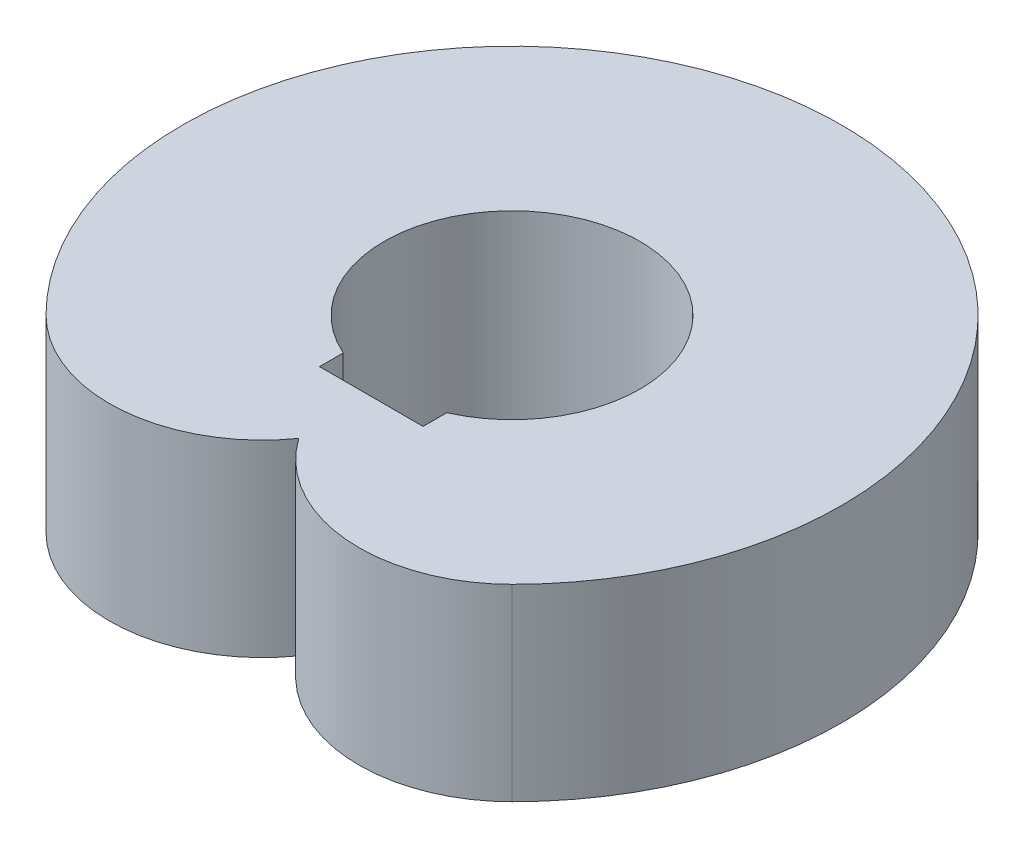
ISO-10303-21;
HEADER;
FILE_DESCRIPTION(('STEP AP214'),'2;1');
FILE_NAME('part.step','',(''),(''),'','','');
FILE_SCHEMA(('AUTOMOTIVE_DESIGN { 1 0 10303 214 1 1 1 1 }'));
ENDSEC;
DATA;
#1=APPLICATION_CONTEXT('core data for automotive mechanical design processes');
#2=APPLICATION_PROTOCOL_DEFINITION('international standard','automotive_design',2000,#1);
#3=PRODUCT_CONTEXT('',#1,'mechanical');
#4=PRODUCT('Part','Part','',(#3));
#5=PRODUCT_RELATED_PRODUCT_CATEGORY('part','',(#4));
#6=PRODUCT_DEFINITION_FORMATION('','',#4);
#7=PRODUCT_DEFINITION_CONTEXT('part definition',#1,'design');
#8=PRODUCT_DEFINITION('design','',#6,#7);
#9=PRODUCT_DEFINITION_SHAPE('','',#8);
#10=(LENGTH_UNIT() NAMED_UNIT(*) SI_UNIT(.MILLI.,.METRE.));
#11=(NAMED_UNIT(*) PLANE_ANGLE_UNIT() SI_UNIT($,.RADIAN.));
#12=(NAMED_UNIT(*) SI_UNIT($,.STERADIAN.) SOLID_ANGLE_UNIT());
#13=UNCERTAINTY_MEASURE_WITH_UNIT(LENGTH_MEASURE(1.E-05),#10,'distance_accuracy_value','');
#14=(GEOMETRIC_REPRESENTATION_CONTEXT(3) GLOBAL_UNCERTAINTY_ASSIGNED_CONTEXT((#13)) GLOBAL_UNIT_ASSIGNED_CONTEXT((#10,
#11,#12)) REPRESENTATION_CONTEXT('',''));
#15=CARTESIAN_POINT('',(0.,0.,0.));
#16=DIRECTION('',(0.,0.,1.));
#17=DIRECTION('',(1.,0.,0.));
#18=AXIS2_PLACEMENT_3D('',#15,#16,#17);
#19=CARTESIAN_POINT('',(132.582521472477,400.,132.582521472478));
#20=DIRECTION('',(0.,1.,0.));
#21=DIRECTION('',(0.,0.,1.));
#22=AXIS2_PLACEMENT_3D('',#19,#20,#21);
#23=PLANE('',#22);
#24=CARTESIAN_POINT('',(265.165042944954,400.,265.165042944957));
#25=DIRECTION('',(0.,1.,0.));
#26=DIRECTION('',(0.,0.,1.));
#27=AXIS2_PLACEMENT_3D('',#24,#25,#26);
#28=CIRCLE('',#27,325.);
#29=CARTESIAN_POINT('',(1.11022302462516E-13,400.,453.08124767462));
#30=VERTEX_POINT('',#29);
#31=CARTESIAN_POINT('',(494.974746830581,400.,494.974746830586));
#32=VERTEX_POINT('',#31);
#33=EDGE_CURVE('E130',#30,#32,#28,.T.);
#34=ORIENTED_EDGE('',*,*,#33,.T.);
#35=CARTESIAN_POINT('',(0.,400.,0.));
#36=DIRECTION('',(0.,1.,0.));
#37=DIRECTION('',(0.,0.,1.));
#38=AXIS2_PLACEMENT_3D('',#35,#36,#37);
#39=CIRCLE('',#38,700.);
#40=CARTESIAN_POINT('',(-494.97474683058,400.,494.974746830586));
#41=VERTEX_POINT('',#40);
#42=EDGE_CURVE('E133',#32,#41,#39,.T.);
#43=ORIENTED_EDGE('',*,*,#42,.T.);
#44=CARTESIAN_POINT('',(-265.165042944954,400.,265.165042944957));
#45=DIRECTION('',(0.,1.,0.));
#46=DIRECTION('',(0.,0.,1.));
#47=AXIS2_PLACEMENT_3D('',#44,#45,#46);
#48=CIRCLE('',#47,325.);
#49=EDGE_CURVE('E136',#41,#30,#48,.T.);
#50=ORIENTED_EDGE('',*,*,#49,.T.);
#51=EDGE_LOOP('',(#34,#43,#50));
#52=FACE_BOUND('',#51,.T.);
#53=DIRECTION('',(1.,0.,0.));
#54=VECTOR('',#53,1.);
#55=CARTESIAN_POINT('',(-110.000000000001,400.,299.));
#56=LINE('',#55,#54);
#57=CARTESIAN_POINT('',(-110.000000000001,400.,299.));
#58=VERTEX_POINT('',#57);
#59=CARTESIAN_POINT('',(110.000000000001,400.,299.));
#60=VERTEX_POINT('',#59);
#61=EDGE_CURVE('E102',#58,#60,#56,.T.);
#62=ORIENTED_EDGE('',*,*,#61,.F.);
#63=DIRECTION('',(0.,0.,1.));
#64=VECTOR('',#63,1.);
#65=CARTESIAN_POINT('',(-110.000000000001,400.,248.581419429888));
#66=LINE('',#65,#64);
#67=CARTESIAN_POINT('',(-110.000000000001,400.,248.581419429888));
#68=VERTEX_POINT('',#67);
#69=EDGE_CURVE('E94',#68,#58,#66,.T.);
#70=ORIENTED_EDGE('',*,*,#69,.F.);
#71=CARTESIAN_POINT('',(0.,400.,0.));
#72=DIRECTION('',(0.,1.,0.));
#73=DIRECTION('',(0.,0.,1.));
#74=AXIS2_PLACEMENT_3D('',#71,#72,#73);
#75=CIRCLE('',#74,271.832157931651);
#76=CARTESIAN_POINT('',(110.000000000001,400.,248.581419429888));
#77=VERTEX_POINT('',#76);
#78=EDGE_CURVE('E116',#77,#68,#75,.T.);
#79=ORIENTED_EDGE('',*,*,#78,.F.);
#80=DIRECTION('',(0.,0.,-1.));
#81=VECTOR('',#80,1.);
#82=CARTESIAN_POINT('',(110.000000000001,400.,248.581419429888));
#83=LINE('',#82,#81);
#84=EDGE_CURVE('E114',#60,#77,#83,.T.);
#85=ORIENTED_EDGE('',*,*,#84,.F.);
#86=EDGE_LOOP('',(#62,#70,#79,#85));
#87=FACE_BOUND('',#86,.T.);
#88=ADVANCED_FACE('F35',(#52,#87),#23,.T.);
#89=CARTESIAN_POINT('',(132.582521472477,0.,132.582521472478));
#90=DIRECTION('',(0.,1.,0.));
#91=DIRECTION('',(0.,0.,1.));
#92=AXIS2_PLACEMENT_3D('',#89,#90,#91);
#93=PLANE('',#92);
#94=CARTESIAN_POINT('',(265.165042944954,0.,265.165042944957));
#95=DIRECTION('',(0.,1.,0.));
#96=DIRECTION('',(0.,0.,1.));
#97=AXIS2_PLACEMENT_3D('',#94,#95,#96);
#98=CIRCLE('',#97,325.);
#99=CARTESIAN_POINT('',(1.11022302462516E-13,0.,453.08124767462));
#100=VERTEX_POINT('',#99);
#101=CARTESIAN_POINT('',(494.974746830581,0.,494.974746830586));
#102=VERTEX_POINT('',#101);
#103=EDGE_CURVE('E110',#100,#102,#98,.T.);
#104=ORIENTED_EDGE('',*,*,#103,.F.);
#105=CARTESIAN_POINT('',(-265.165042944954,0.,265.165042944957));
#106=DIRECTION('',(0.,1.,0.));
#107=DIRECTION('',(0.,0.,1.));
#108=AXIS2_PLACEMENT_3D('',#105,#106,#107);
#109=CIRCLE('',#108,325.);
#110=CARTESIAN_POINT('',(-494.97474683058,0.,494.974746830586));
#111=VERTEX_POINT('',#110);
#112=EDGE_CURVE('E134',#111,#100,#109,.T.);
#113=ORIENTED_EDGE('',*,*,#112,.F.);
#114=CARTESIAN_POINT('',(0.,0.,0.));
#115=DIRECTION('',(0.,1.,0.));
#116=DIRECTION('',(0.,0.,1.));
#117=AXIS2_PLACEMENT_3D('',#114,#115,#116);
#118=CIRCLE('',#117,700.);
#119=EDGE_CURVE('E141',#102,#111,#118,.T.);
#120=ORIENTED_EDGE('',*,*,#119,.F.);
#121=EDGE_LOOP('',(#104,#113,#120));
#122=FACE_BOUND('',#121,.T.);
#123=DIRECTION('',(0.,0.,1.));
#124=VECTOR('',#123,1.);
#125=CARTESIAN_POINT('',(-110.000000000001,0.,248.581419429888));
#126=LINE('',#125,#124);
#127=CARTESIAN_POINT('',(-110.000000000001,0.,248.581419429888));
#128=VERTEX_POINT('',#127);
#129=CARTESIAN_POINT('',(-110.000000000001,0.,299.));
#130=VERTEX_POINT('',#129);
#131=EDGE_CURVE('E58',#128,#130,#126,.T.);
#132=ORIENTED_EDGE('',*,*,#131,.T.);
#133=DIRECTION('',(1.,0.,0.));
#134=VECTOR('',#133,1.);
#135=CARTESIAN_POINT('',(-110.000000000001,0.,299.));
#136=LINE('',#135,#134);
#137=CARTESIAN_POINT('',(110.000000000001,0.,299.));
#138=VERTEX_POINT('',#137);
#139=EDGE_CURVE('E109',#130,#138,#136,.T.);
#140=ORIENTED_EDGE('',*,*,#139,.T.);
#141=DIRECTION('',(0.,0.,-1.));
#142=VECTOR('',#141,1.);
#143=CARTESIAN_POINT('',(110.000000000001,0.,248.581419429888));
#144=LINE('',#143,#142);
#145=CARTESIAN_POINT('',(110.000000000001,0.,248.581419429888));
#146=VERTEX_POINT('',#145);
#147=EDGE_CURVE('E122',#138,#146,#144,.T.);
#148=ORIENTED_EDGE('',*,*,#147,.T.);
#149=CARTESIAN_POINT('',(0.,0.,0.));
#150=DIRECTION('',(0.,1.,0.));
#151=DIRECTION('',(0.,0.,1.));
#152=AXIS2_PLACEMENT_3D('',#149,#150,#151);
#153=CIRCLE('',#152,271.832157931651);
#154=EDGE_CURVE('E103',#146,#128,#153,.T.);
#155=ORIENTED_EDGE('',*,*,#154,.T.);
#156=EDGE_LOOP('',(#132,#140,#148,#155));
#157=FACE_BOUND('',#156,.T.);
#158=ADVANCED_FACE('F155',(#122,#157),#93,.F.);
#159=CARTESIAN_POINT('',(265.165042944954,400.,265.165042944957));
#160=DIRECTION('',(0.,-1.,0.));
#161=DIRECTION('',(0.,0.,-1.));
#162=AXIS2_PLACEMENT_3D('',#159,#160,#161);
#163=CYLINDRICAL_SURFACE('',#162,325.);
#164=ORIENTED_EDGE('',*,*,#103,.T.);
#165=DIRECTION('',(0.,-1.,0.));
#166=VECTOR('',#165,1.);
#167=CARTESIAN_POINT('',(494.974746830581,400.,494.974746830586));
#168=LINE('',#167,#166);
#169=EDGE_CURVE('E11',#32,#102,#168,.T.);
#170=ORIENTED_EDGE('',*,*,#169,.F.);
#171=ORIENTED_EDGE('',*,*,#33,.F.);
#172=DIRECTION('',(0.,-1.,0.));
#173=VECTOR('',#172,1.);
#174=CARTESIAN_POINT('',(1.11022302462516E-13,400.,453.08124767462));
#175=LINE('',#174,#173);
#176=EDGE_CURVE('E138',#30,#100,#175,.T.);
#177=ORIENTED_EDGE('',*,*,#176,.T.);
#178=EDGE_LOOP('',(#164,#170,#171,#177));
#179=FACE_BOUND('',#178,.T.);
#180=ADVANCED_FACE('F37',(#179),#163,.T.);
#181=CARTESIAN_POINT('',(0.,400.,0.));
#182=DIRECTION('',(0.,-1.,0.));
#183=DIRECTION('',(0.,0.,-1.));
#184=AXIS2_PLACEMENT_3D('',#181,#182,#183);
#185=CYLINDRICAL_SURFACE('',#184,700.);
#186=ORIENTED_EDGE('',*,*,#119,.T.);
#187=DIRECTION('',(0.,-1.,0.));
#188=VECTOR('',#187,1.);
#189=CARTESIAN_POINT('',(-494.97474683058,400.,494.974746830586));
#190=LINE('',#189,#188);
#191=EDGE_CURVE('E43',#41,#111,#190,.T.);
#192=ORIENTED_EDGE('',*,*,#191,.F.);
#193=ORIENTED_EDGE('',*,*,#42,.F.);
#194=ORIENTED_EDGE('',*,*,#169,.T.);
#195=EDGE_LOOP('',(#186,#192,#193,#194));
#196=FACE_BOUND('',#195,.T.);
#197=ADVANCED_FACE('F161',(#196),#185,.T.);
#198=CARTESIAN_POINT('',(-265.165042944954,400.,265.165042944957));
#199=DIRECTION('',(0.,-1.,0.));
#200=DIRECTION('',(0.,0.,-1.));
#201=AXIS2_PLACEMENT_3D('',#198,#199,#200);
#202=CYLINDRICAL_SURFACE('',#201,325.);
#203=ORIENTED_EDGE('',*,*,#112,.T.);
#204=ORIENTED_EDGE('',*,*,#176,.F.);
#205=ORIENTED_EDGE('',*,*,#49,.F.);
#206=ORIENTED_EDGE('',*,*,#191,.T.);
#207=EDGE_LOOP('',(#203,#204,#205,#206));
#208=FACE_BOUND('',#207,.T.);
#209=ADVANCED_FACE('F150',(#208),#202,.T.);
#210=CARTESIAN_POINT('',(-110.000000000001,400.,248.581419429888));
#211=DIRECTION('',(1.,0.,0.));
#212=DIRECTION('',(0.,0.,-1.));
#213=AXIS2_PLACEMENT_3D('',#210,#211,#212);
#214=PLANE('',#213);
#215=ORIENTED_EDGE('',*,*,#131,.F.);
#216=DIRECTION('',(0.,-1.,0.));
#217=VECTOR('',#216,1.);
#218=CARTESIAN_POINT('',(-110.000000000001,400.,248.581419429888));
#219=LINE('',#218,#217);
#220=EDGE_CURVE('E98',#68,#128,#219,.T.);
#221=ORIENTED_EDGE('',*,*,#220,.F.);
#222=ORIENTED_EDGE('',*,*,#69,.T.);
#223=DIRECTION('',(0.,-1.,0.));
#224=VECTOR('',#223,1.);
#225=CARTESIAN_POINT('',(-110.000000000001,400.,299.));
#226=LINE('',#225,#224);
#227=EDGE_CURVE('E97',#58,#130,#226,.T.);
#228=ORIENTED_EDGE('',*,*,#227,.T.);
#229=EDGE_LOOP('',(#215,#221,#222,#228));
#230=FACE_BOUND('',#229,.T.);
#231=ADVANCED_FACE('F96',(#230),#214,.T.);
#232=CARTESIAN_POINT('',(-110.000000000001,400.,299.));
#233=DIRECTION('',(0.,0.,-1.));
#234=DIRECTION('',(-1.,0.,0.));
#235=AXIS2_PLACEMENT_3D('',#232,#233,#234);
#236=PLANE('',#235);
#237=ORIENTED_EDGE('',*,*,#139,.F.);
#238=ORIENTED_EDGE('',*,*,#227,.F.);
#239=ORIENTED_EDGE('',*,*,#61,.T.);
#240=DIRECTION('',(0.,-1.,0.));
#241=VECTOR('',#240,1.);
#242=CARTESIAN_POINT('',(110.000000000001,400.,299.));
#243=LINE('',#242,#241);
#244=EDGE_CURVE('E111',#60,#138,#243,.T.);
#245=ORIENTED_EDGE('',*,*,#244,.T.);
#246=EDGE_LOOP('',(#237,#238,#239,#245));
#247=FACE_BOUND('',#246,.T.);
#248=ADVANCED_FACE('F106',(#247),#236,.T.);
#249=CARTESIAN_POINT('',(110.000000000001,400.,248.581419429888));
#250=DIRECTION('',(-1.,0.,0.));
#251=DIRECTION('',(0.,0.,1.));
#252=AXIS2_PLACEMENT_3D('',#249,#250,#251);
#253=PLANE('',#252);
#254=ORIENTED_EDGE('',*,*,#147,.F.);
#255=ORIENTED_EDGE('',*,*,#244,.F.);
#256=ORIENTED_EDGE('',*,*,#84,.T.);
#257=DIRECTION('',(0.,-1.,0.));
#258=VECTOR('',#257,1.);
#259=CARTESIAN_POINT('',(110.000000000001,400.,248.581419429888));
#260=LINE('',#259,#258);
#261=EDGE_CURVE('E50',#77,#146,#260,.T.);
#262=ORIENTED_EDGE('',*,*,#261,.T.);
#263=EDGE_LOOP('',(#254,#255,#256,#262));
#264=FACE_BOUND('',#263,.T.);
#265=ADVANCED_FACE('F179',(#264),#253,.T.);
#266=CARTESIAN_POINT('',(0.,400.,0.));
#267=DIRECTION('',(0.,-1.,0.));
#268=DIRECTION('',(0.,0.,-1.));
#269=AXIS2_PLACEMENT_3D('',#266,#267,#268);
#270=CYLINDRICAL_SURFACE('',#269,271.832157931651);
#271=ORIENTED_EDGE('',*,*,#154,.F.);
#272=ORIENTED_EDGE('',*,*,#261,.F.);
#273=ORIENTED_EDGE('',*,*,#78,.T.);
#274=ORIENTED_EDGE('',*,*,#220,.T.);
#275=EDGE_LOOP('',(#271,#272,#273,#274));
#276=FACE_BOUND('',#275,.T.);
#277=ADVANCED_FACE('F182',(#276),#270,.F.);
#278=CLOSED_SHELL('',(#88,#158,#180,#197,#209,#231,#248,#265,#277));
#279=MANIFOLD_SOLID_BREP('B2',#278);
#280=ADVANCED_BREP_SHAPE_REPRESENTATION('',(#18,#279),#14);
#281=SHAPE_DEFINITION_REPRESENTATION(#9,#280);
ENDSEC;
END-ISO-10303-21;
